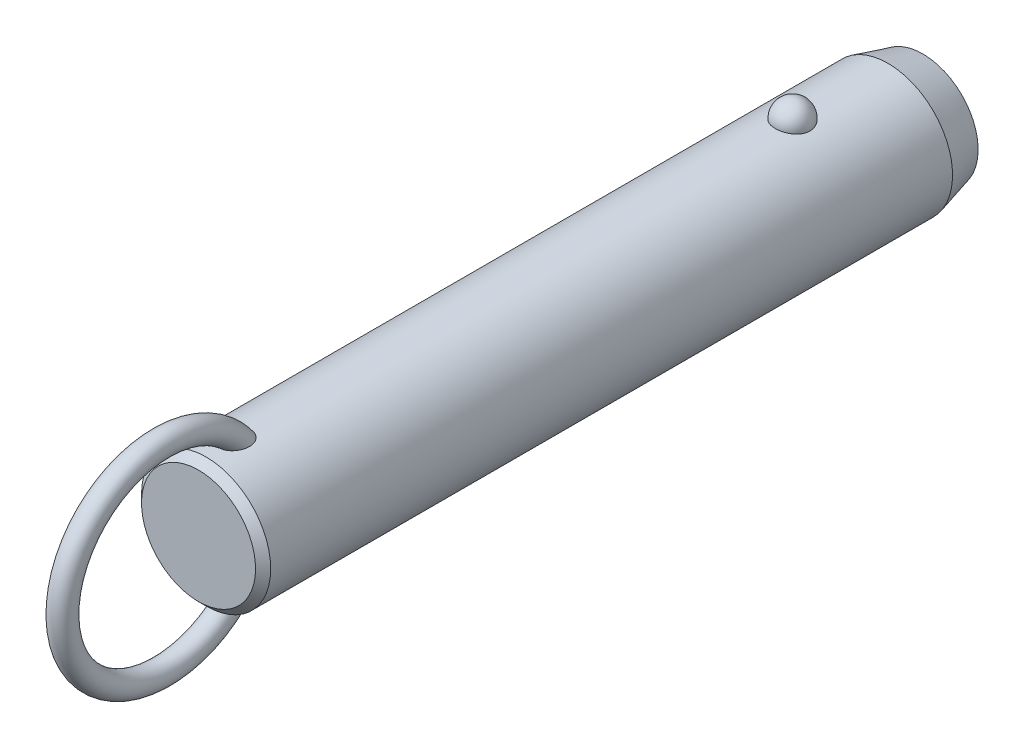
ISO-10303-21;
HEADER;
FILE_DESCRIPTION(('STEP AP214'),'2;1');
FILE_NAME('part.step','',(''),(''),'','','');
FILE_SCHEMA(('AUTOMOTIVE_DESIGN { 1 0 10303 214 1 1 1 1 }'));
ENDSEC;
DATA;
#1=APPLICATION_CONTEXT('core data for automotive mechanical design processes');
#2=APPLICATION_PROTOCOL_DEFINITION('international standard','automotive_design',2000,#1);
#3=PRODUCT_CONTEXT('',#1,'mechanical');
#4=PRODUCT('Part','Part','',(#3));
#5=PRODUCT_RELATED_PRODUCT_CATEGORY('part','',(#4));
#6=PRODUCT_DEFINITION_FORMATION('','',#4);
#7=PRODUCT_DEFINITION_CONTEXT('part definition',#1,'design');
#8=PRODUCT_DEFINITION('design','',#6,#7);
#9=PRODUCT_DEFINITION_SHAPE('','',#8);
#10=(LENGTH_UNIT() NAMED_UNIT(*) SI_UNIT(.MILLI.,.METRE.));
#11=(NAMED_UNIT(*) PLANE_ANGLE_UNIT() SI_UNIT($,.RADIAN.));
#12=(NAMED_UNIT(*) SI_UNIT($,.STERADIAN.) SOLID_ANGLE_UNIT());
#13=UNCERTAINTY_MEASURE_WITH_UNIT(LENGTH_MEASURE(1.E-05),#10,'distance_accuracy_value','');
#14=(GEOMETRIC_REPRESENTATION_CONTEXT(3) GLOBAL_UNCERTAINTY_ASSIGNED_CONTEXT((#13)) GLOBAL_UNIT_ASSIGNED_CONTEXT((#10,
#11,#12)) REPRESENTATION_CONTEXT('',''));
#15=CARTESIAN_POINT('',(0.,0.,0.));
#16=DIRECTION('',(0.,0.,1.));
#17=DIRECTION('',(1.,0.,0.));
#18=AXIS2_PLACEMENT_3D('',#15,#16,#17);
#19=CARTESIAN_POINT('',(0.,0.,86.4));
#20=DIRECTION('',(0.,0.,-1.));
#21=DIRECTION('',(-1.,0.,0.));
#22=AXIS2_PLACEMENT_3D('',#19,#20,#21);
#23=CYLINDRICAL_SURFACE('',#22,11.1);
#24=CARTESIAN_POINT('',(2.9724815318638,10.6945945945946,-3.));
#25=CARTESIAN_POINT('',(2.97247830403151,10.6945972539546,-2.83225059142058));
#26=CARTESIAN_POINT('',(2.95876598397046,10.6984356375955,-2.6644597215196));
#27=CARTESIAN_POINT('',(2.90424529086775,10.7133624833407,-2.33362381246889));
#28=CARTESIAN_POINT('',(2.8634252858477,10.7244540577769,-2.1705808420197));
#29=CARTESIAN_POINT('',(2.75573657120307,10.7526272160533,-1.85396767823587));
#30=CARTESIAN_POINT('',(2.68887937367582,10.7697061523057,-1.70039333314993));
#31=CARTESIAN_POINT('',(2.53079696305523,10.8079438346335,-1.40691598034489));
#32=CARTESIAN_POINT('',(2.43957264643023,10.8291024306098,-1.2670124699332));
#33=CARTESIAN_POINT('',(2.23458150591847,10.8732541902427,-1.00409565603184));
#34=CARTESIAN_POINT('',(2.12071295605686,10.8962553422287,-0.881162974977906));
#35=CARTESIAN_POINT('',(1.87365402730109,10.9414421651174,-0.656352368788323));
#36=CARTESIAN_POINT('',(1.74046358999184,10.9636278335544,-0.554474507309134));
#37=CARTESIAN_POINT('',(1.45872188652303,11.0046495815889,-0.374872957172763));
#38=CARTESIAN_POINT('',(1.31021276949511,11.0234944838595,-0.297085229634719));
#39=CARTESIAN_POINT('',(1.00170030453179,11.0557957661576,-0.16752977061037));
#40=CARTESIAN_POINT('',(0.841698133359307,11.0692526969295,-0.115759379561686));
#41=CARTESIAN_POINT('',(0.517607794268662,11.0890932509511,-0.0403925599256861));
#42=CARTESIAN_POINT('',(0.353633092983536,11.0955916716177,-0.0163383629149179));
#43=CARTESIAN_POINT('',(0.02384202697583,11.1011989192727,0.00445177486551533));
#44=CARTESIAN_POINT('',(-0.141974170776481,11.1003084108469,0.00119017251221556));
#45=CARTESIAN_POINT('',(-0.46840517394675,11.0912990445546,-0.0323233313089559));
#46=CARTESIAN_POINT('',(-0.629059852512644,11.0832767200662,-0.0622147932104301));
#47=CARTESIAN_POINT('',(-0.942937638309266,11.0609962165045,-0.147645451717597));
#48=CARTESIAN_POINT('',(-1.09616062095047,11.0467379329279,-0.203185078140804));
#49=CARTESIAN_POINT('',(-1.39181061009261,11.0134071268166,-0.3387529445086));
#50=CARTESIAN_POINT('',(-1.53417383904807,10.9943086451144,-0.418913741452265));
#51=CARTESIAN_POINT('',(-1.80342160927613,10.9533667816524,-0.601448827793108));
#52=CARTESIAN_POINT('',(-1.9303046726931,10.9315231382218,-0.703825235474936));
#53=CARTESIAN_POINT('',(-2.16747598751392,10.887005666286,-0.930091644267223));
#54=CARTESIAN_POINT('',(-2.27742774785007,10.8643239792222,-1.05433291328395));
#55=CARTESIAN_POINT('',(-2.47517316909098,10.8209886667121,-1.31966633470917));
#56=CARTESIAN_POINT('',(-2.56296538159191,10.8003351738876,-1.46075958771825));
#57=CARTESIAN_POINT('',(-2.71500300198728,10.7631304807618,-1.75753646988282));
#58=CARTESIAN_POINT('',(-2.77898901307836,10.7466250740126,-1.9133588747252));
#59=CARTESIAN_POINT('',(-2.88046189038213,10.7198747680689,-2.2339152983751));
#60=CARTESIAN_POINT('',(-2.91794947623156,10.709629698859,-2.39864907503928));
#61=CARTESIAN_POINT('',(-2.96537819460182,10.6965949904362,-2.73165170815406));
#62=CARTESIAN_POINT('',(-2.97542891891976,10.693775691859,-2.89990378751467));
#63=CARTESIAN_POINT('',(-2.96804271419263,10.6958279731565,-3.235752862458));
#64=CARTESIAN_POINT('',(-2.95060646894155,10.7006993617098,-3.40334987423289));
#65=CARTESIAN_POINT('',(-2.88883358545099,10.71753912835,-3.73233906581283));
#66=CARTESIAN_POINT('',(-2.84462026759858,10.7294749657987,-3.89375610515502));
#67=CARTESIAN_POINT('',(-2.73050447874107,10.7590797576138,-4.20667949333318));
#68=CARTESIAN_POINT('',(-2.66060103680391,10.7767489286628,-4.35818546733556));
#69=CARTESIAN_POINT('',(-2.49642559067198,10.8159599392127,-4.6478542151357));
#70=CARTESIAN_POINT('',(-2.40203047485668,10.8375211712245,-4.78594458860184));
#71=CARTESIAN_POINT('',(-2.19143488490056,10.8820570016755,-5.0441038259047));
#72=CARTESIAN_POINT('',(-2.07523364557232,10.9050316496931,-5.16417205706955));
#73=CARTESIAN_POINT('',(-1.82361254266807,10.9499219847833,-5.38334833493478));
#74=CARTESIAN_POINT('',(-1.68812945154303,10.9718338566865,-5.48238464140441));
#75=CARTESIAN_POINT('',(-1.40191298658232,11.0120611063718,-5.65618873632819));
#76=CARTESIAN_POINT('',(-1.25118062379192,11.0303767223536,-5.73095813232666));
#77=CARTESIAN_POINT('',(-0.94057074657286,11.0611653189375,-5.85334725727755));
#78=CARTESIAN_POINT('',(-0.780821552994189,11.0737044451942,-5.90127578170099));
#79=CARTESIAN_POINT('',(-0.455204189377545,11.0918598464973,-5.96992976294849));
#80=CARTESIAN_POINT('',(-0.289336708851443,11.0974768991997,-5.99065827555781));
#81=CARTESIAN_POINT('',(0.0406846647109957,11.1011307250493,-6.00418773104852));
#82=CARTESIAN_POINT('',(0.204817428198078,11.099299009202,-5.99747318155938));
#83=CARTESIAN_POINT('',(0.529553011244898,11.088551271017,-5.9574031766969));
#84=CARTESIAN_POINT('',(0.690155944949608,11.0796354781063,-5.92404858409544));
#85=CARTESIAN_POINT('',(1.0027760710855,11.0557204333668,-5.83180084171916));
#86=CARTESIAN_POINT('',(1.15482001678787,11.0407414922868,-5.77299291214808));
#87=CARTESIAN_POINT('',(1.44678373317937,11.0062913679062,-5.63147366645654));
#88=CARTESIAN_POINT('',(1.58670279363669,10.9868199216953,-5.54876095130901));
#89=CARTESIAN_POINT('',(1.8527023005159,10.9451315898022,-5.36027644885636));
#90=CARTESIAN_POINT('',(1.97855158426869,10.9228788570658,-5.25418644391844));
#91=CARTESIAN_POINT('',(2.21080872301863,10.8782509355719,-5.02251354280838));
#92=CARTESIAN_POINT('',(2.31721312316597,10.8558757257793,-4.89692718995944));
#93=CARTESIAN_POINT('',(2.5094551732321,10.8130715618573,-4.62745408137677));
#94=CARTESIAN_POINT('',(2.59493284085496,10.7926798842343,-4.48330448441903));
#95=CARTESIAN_POINT('',(2.740862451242,10.7565495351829,-4.18236358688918));
#96=CARTESIAN_POINT('',(2.80132490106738,10.7408089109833,-4.02557762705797));
#97=CARTESIAN_POINT('',(2.88959070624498,10.7173718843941,-3.72475308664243));
#98=CARTESIAN_POINT('',(2.92062102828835,10.7088950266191,-3.58171216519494));
#99=CARTESIAN_POINT('',(2.96206765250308,10.6975052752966,-3.29245795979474));
#100=CARTESIAN_POINT('',(2.97248434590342,10.6945922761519,-3.14624473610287));
#101=CARTESIAN_POINT('',(2.9724815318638,10.6945945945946,-3.));
#102=B_SPLINE_CURVE_WITH_KNOTS('',3,(#24,#25,#26,#27,#28,#29,#30,#31,#32,#33,#34,#35,#36,#37,
#38,#39,#40,#41,#42,#43,#44,#45,#46,#47,#48,#49,#50,#51,#52,#53,#54,#55,#56,#57,#58,#59,#60,#61,
#62,#63,#64,#65,#66,#67,#68,#69,#70,#71,#72,#73,#74,#75,#76,#77,#78,#79,#80,#81,#82,#83,#84,#85,
#86,#87,#88,#89,#90,#91,#92,#93,#94,#95,#96,#97,#98,#99,#100,#101),.UNSPECIFIED.,.T.,.F.,(4,2,2,
2,2,2,2,2,2,2,2,2,2,2,2,2,2,2,2,2,2,2,2,2,2,2,2,2,2,2,2,2,2,2,2,2,2,2,4),(0.,0.502722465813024,
1.00566079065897,1.50837699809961,2.01107471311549,2.51608392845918,3.02109467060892,
3.52475118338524,4.02835620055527,4.523518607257,5.0186364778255,5.50715297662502,
5.9956776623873,6.48688002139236,6.97812923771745,7.47814366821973,7.9781907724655,
8.48353712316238,8.9888697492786,9.49218093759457,9.99547960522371,10.4964777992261,
10.997494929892,11.5010810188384,12.0046847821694,12.5099796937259,13.0152411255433,
13.5145635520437,14.0138298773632,14.5043200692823,14.9947943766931,15.4836390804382,
15.9725123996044,16.4685040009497,16.9645836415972,17.4686765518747,17.972557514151,
18.410841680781,18.849117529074),.UNSPECIFIED.);
#103=CARTESIAN_POINT('',(2.9724815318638,10.6945945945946,-3.));
#104=VERTEX_POINT('',#103);
#105=EDGE_CURVE('E41',#104,#104,#102,.T.);
#106=ORIENTED_EDGE('',*,*,#105,.T.);
#107=EDGE_LOOP('',(#106));
#108=FACE_BOUND('',#107,.T.);
#109=CARTESIAN_POINT('',(0.,0.,97.8000000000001));
#110=DIRECTION('',(0.,0.,1.));
#111=DIRECTION('',(1.,0.,0.));
#112=AXIS2_PLACEMENT_3D('',#109,#110,#111);
#113=CIRCLE('',#112,11.1);
#114=CARTESIAN_POINT('',(11.1,0.,97.8000000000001));
#115=VERTEX_POINT('',#114);
#116=EDGE_CURVE('E10',#115,#115,#113,.F.);
#117=ORIENTED_EDGE('',*,*,#116,.T.);
#118=EDGE_LOOP('',(#117));
#119=FACE_BOUND('',#118,.T.);
#120=CARTESIAN_POINT('',(-0.564520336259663,-11.0856356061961,90.0578154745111));
#121=CARTESIAN_POINT('',(-0.667202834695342,-11.0804062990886,90.0912839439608));
#122=CARTESIAN_POINT('',(-0.766875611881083,-11.0738877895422,90.1338357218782));
#123=CARTESIAN_POINT('',(-0.957284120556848,-11.0590576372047,90.2354190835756));
#124=CARTESIAN_POINT('',(-1.04801616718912,-11.0507452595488,90.2944574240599));
#125=CARTESIAN_POINT('',(-1.21800952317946,-11.0333016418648,90.4265293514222));
#126=CARTESIAN_POINT('',(-1.29730805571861,-11.0241732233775,90.4995156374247));
#127=CARTESIAN_POINT('',(-1.44337665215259,-11.0060026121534,90.6570374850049));
#128=CARTESIAN_POINT('',(-1.51014622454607,-10.9969604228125,90.7415734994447));
#129=CARTESIAN_POINT('',(-1.63454620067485,-10.9791841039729,90.9255213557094));
#130=CARTESIAN_POINT('',(-1.69127003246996,-10.9705107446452,91.0255493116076));
#131=CARTESIAN_POINT('',(-1.78980785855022,-10.9548648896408,91.2327902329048));
#132=CARTESIAN_POINT('',(-1.83161214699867,-10.9478935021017,91.3400078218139));
#133=CARTESIAN_POINT('',(-1.91557028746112,-10.9335803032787,91.6054080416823));
#134=CARTESIAN_POINT('',(-1.95040620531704,-10.9273269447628,91.7659806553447));
#135=CARTESIAN_POINT('',(-1.99388326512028,-10.9194709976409,92.0906977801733));
#136=CARTESIAN_POINT('',(-2.00248051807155,-10.9178762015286,92.2548478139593));
#137=CARTESIAN_POINT('',(-1.99551615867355,-10.9191578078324,92.6246504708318));
#138=CARTESIAN_POINT('',(-1.9732206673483,-10.9232807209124,92.8301911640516));
#139=CARTESIAN_POINT('',(-1.91529761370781,-10.9335244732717,93.133595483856));
#140=CARTESIAN_POINT('',(-1.8918457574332,-10.9376266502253,93.2340883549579));
#141=CARTESIAN_POINT('',(-1.83700674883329,-10.9469720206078,93.432855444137));
#142=CARTESIAN_POINT('',(-1.80562070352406,-10.9522150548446,93.5311299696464));
#143=CARTESIAN_POINT('',(-1.73463055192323,-10.9636837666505,93.7259148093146));
#144=CARTESIAN_POINT('',(-1.69493416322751,-10.9699202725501,93.8223907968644));
#145=CARTESIAN_POINT('',(-1.60745141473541,-10.9830806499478,94.0116262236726));
#146=CARTESIAN_POINT('',(-1.55966150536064,-10.9900048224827,94.1043840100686));
#147=CARTESIAN_POINT('',(-1.45591812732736,-11.0042280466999,94.2846907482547));
#148=CARTESIAN_POINT('',(-1.40000013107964,-11.0115253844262,94.3722601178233));
#149=CARTESIAN_POINT('',(-1.27937470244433,-11.0261911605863,94.5410298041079));
#150=CARTESIAN_POINT('',(-1.21467835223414,-11.0335594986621,94.6222379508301));
#151=CARTESIAN_POINT('',(-1.08218150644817,-11.0473027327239,94.7690010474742));
#152=CARTESIAN_POINT('',(-1.01522633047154,-11.0537063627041,94.835309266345));
#153=CARTESIAN_POINT('',(-0.872952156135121,-11.065850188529,94.9583780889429));
#154=CARTESIAN_POINT('',(-0.797642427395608,-11.0715911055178,95.0151491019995));
#155=CARTESIAN_POINT('',(-0.651396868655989,-11.081071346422,95.1075155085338));
#156=CARTESIAN_POINT('',(-0.58171263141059,-11.0849841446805,95.1450491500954));
#157=CARTESIAN_POINT('',(-0.437066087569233,-11.0916271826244,95.2082594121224));
#158=CARTESIAN_POINT('',(-0.362109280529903,-11.0943586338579,95.2339481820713));
#159=CARTESIAN_POINT('',(-0.207828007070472,-11.0983242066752,95.271117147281));
#160=CARTESIAN_POINT('',(-0.128467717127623,-11.0995432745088,95.2824545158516));
#161=CARTESIAN_POINT('',(0.0309101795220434,-11.1002423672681,95.2889658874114));
#162=CARTESIAN_POINT('',(0.110927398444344,-11.0997233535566,95.2841488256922));
#163=CARTESIAN_POINT('',(0.256406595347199,-11.097240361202,95.2609599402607));
#164=CARTESIAN_POINT('',(0.32223577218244,-11.0955074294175,95.2447543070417));
#165=CARTESIAN_POINT('',(0.450635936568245,-11.0910350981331,95.2026008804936));
#166=CARTESIAN_POINT('',(0.513205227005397,-11.0882951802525,95.1766480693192));
#167=CARTESIAN_POINT('',(0.662626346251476,-11.0805620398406,95.1026073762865));
#168=CARTESIAN_POINT('',(0.747127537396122,-11.0751144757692,95.0498452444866));
#169=CARTESIAN_POINT('',(0.906756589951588,-11.0631932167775,94.9317206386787));
#170=CARTESIAN_POINT('',(0.981859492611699,-11.0567168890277,94.8663257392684));
#171=CARTESIAN_POINT('',(1.10712207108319,-11.0447856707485,94.7422633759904));
#172=CARTESIAN_POINT('',(1.1590956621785,-11.0394280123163,94.6853831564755));
#173=CARTESIAN_POINT('',(1.25791923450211,-11.0286040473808,94.5673271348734));
#174=CARTESIAN_POINT('',(1.3047664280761,-11.0231376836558,94.5061490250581));
#175=CARTESIAN_POINT('',(1.43818612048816,-11.0068027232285,94.317305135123));
#176=CARTESIAN_POINT('',(1.5175176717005,-10.9960104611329,94.1844531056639));
#177=CARTESIAN_POINT('',(1.63597546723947,-10.9788847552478,93.9531371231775));
#178=CARTESIAN_POINT('',(1.6798887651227,-10.9722190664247,93.8570530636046));
#179=CARTESIAN_POINT('',(1.75953241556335,-10.9597298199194,93.6614311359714));
#180=CARTESIAN_POINT('',(1.79525967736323,-10.9539065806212,93.5618919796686));
#181=CARTESIAN_POINT('',(1.85844731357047,-10.9433632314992,93.3602111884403));
#182=CARTESIAN_POINT('',(1.88591073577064,-10.9386427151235,93.2580705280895));
#183=CARTESIAN_POINT('',(1.9323432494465,-10.9305350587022,93.0518191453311));
#184=CARTESIAN_POINT('',(1.95131065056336,-10.9271481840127,92.9477080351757));
#185=CARTESIAN_POINT('',(1.99040203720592,-10.9201183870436,92.6654588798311));
#186=CARTESIAN_POINT('',(2.00221217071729,-10.9179256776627,92.4860370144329));
#187=CARTESIAN_POINT('',(1.99711676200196,-10.9188636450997,92.1277133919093));
#188=CARTESIAN_POINT('',(1.98026150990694,-10.9219849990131,91.948811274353));
#189=CARTESIAN_POINT('',(1.92151657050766,-10.9324473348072,91.6364514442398));
#190=CARTESIAN_POINT('',(1.88605081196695,-10.9386915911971,91.5017594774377));
#191=CARTESIAN_POINT('',(1.79393020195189,-10.9541780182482,91.2399669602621));
#192=CARTESIAN_POINT('',(1.73729868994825,-10.9634168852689,91.1128582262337));
#193=CARTESIAN_POINT('',(1.61237037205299,-10.9824218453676,90.8894184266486));
#194=CARTESIAN_POINT('',(1.54715374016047,-10.9918945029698,90.7913455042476));
#195=CARTESIAN_POINT('',(1.40127026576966,-11.0114415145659,90.6074341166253));
#196=CARTESIAN_POINT('',(1.32060742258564,-11.0215157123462,90.5215924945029));
#197=CARTESIAN_POINT('',(1.14474787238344,-11.041168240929,90.3651630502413));
#198=CARTESIAN_POINT('',(1.04947805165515,-11.0507437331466,90.2946565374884));
#199=CARTESIAN_POINT('',(0.847278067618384,-11.0680789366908,90.172640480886));
#200=CARTESIAN_POINT('',(0.74035174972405,-11.0758392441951,90.1211246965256));
#201=CARTESIAN_POINT('',(0.52928931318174,-11.0878275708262,90.0434852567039));
#202=CARTESIAN_POINT('',(0.425895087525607,-11.0923259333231,90.0153777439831));
#203=CARTESIAN_POINT('',(0.215723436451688,-11.0984001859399,89.9777038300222));
#204=CARTESIAN_POINT('',(0.108947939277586,-11.0999777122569,89.9681270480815));
#205=CARTESIAN_POINT('',(-0.0938962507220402,-11.1000196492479,89.9678773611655));
#206=CARTESIAN_POINT('',(-0.189967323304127,-11.0987797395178,89.9754089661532));
#207=CARTESIAN_POINT('',(-0.379657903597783,-11.0939111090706,90.0055079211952));
#208=CARTESIAN_POINT('',(-0.473277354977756,-11.0902823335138,90.0280756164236));
#209=CARTESIAN_POINT('',(-0.564520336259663,-11.0856356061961,90.0578154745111));
#210=B_SPLINE_CURVE_WITH_KNOTS('',3,(#120,#121,#122,#123,#124,#125,#126,#127,#128,#129,#130,
#131,#132,#133,#134,#135,#136,#137,#138,#139,#140,#141,#142,#143,#144,#145,#146,#147,#148,#149,
#150,#151,#152,#153,#154,#155,#156,#157,#158,#159,#160,#161,#162,#163,#164,#165,#166,#167,#168,
#169,#170,#171,#172,#173,#174,#175,#176,#177,#178,#179,#180,#181,#182,#183,#184,#185,#186,#187,
#188,#189,#190,#191,#192,#193,#194,#195,#196,#197,#198,#199,#200,#201,#202,#203,#204,#205,#206,
#207,#208,#209),.UNSPECIFIED.,.T.,.F.,(4,2,2,2,2,2,2,2,2,2,2,2,2,2,2,2,2,2,2,2,2,2,2,2,2,2,2,2,
2,2,2,2,2,2,2,2,2,2,2,2,2,2,2,2,4),(0.,0.323999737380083,0.648132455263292,0.971184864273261,
1.29424994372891,1.6388623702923,1.98369857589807,2.47426059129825,2.96564271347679,
3.58257396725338,3.89215258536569,4.20168803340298,4.51486273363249,4.82817514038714,
5.14015911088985,5.45175282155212,5.73442856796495,6.01679375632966,6.25364580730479,
6.49025437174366,6.72919963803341,6.96801276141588,7.17061258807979,7.37331685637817,
7.67094989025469,7.96935728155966,8.20075067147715,8.43226927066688,8.89581623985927,
9.21306533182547,9.53043400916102,9.8476854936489,10.1650000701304,10.70229304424,
11.2386443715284,11.6553390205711,12.0715755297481,12.4245637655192,12.7774607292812,
13.1321855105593,13.4867936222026,13.8068771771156,14.1267813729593,14.4146787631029,
14.7025827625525),.UNSPECIFIED.);
#211=CARTESIAN_POINT('',(-0.564520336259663,-11.0856356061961,90.0578154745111));
#212=VERTEX_POINT('',#211);
#213=EDGE_CURVE('E60',#212,#212,#210,.T.);
#214=ORIENTED_EDGE('',*,*,#213,.T.);
#215=EDGE_LOOP('',(#214));
#216=FACE_BOUND('',#215,.T.);
#217=CARTESIAN_POINT('',(-0.564520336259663,11.0856356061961,90.0578154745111));
#218=CARTESIAN_POINT('',(-0.468542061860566,11.0905203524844,90.0265456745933));
#219=CARTESIAN_POINT('',(-0.36979381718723,11.0942886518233,90.0031576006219));
#220=CARTESIAN_POINT('',(-0.169555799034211,11.0991586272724,89.9730858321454));
#221=CARTESIAN_POINT('',(-0.0680604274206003,11.1002543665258,89.9664393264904));
#222=CARTESIAN_POINT('',(0.134549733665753,11.099646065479,89.9701579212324));
#223=CARTESIAN_POINT('',(0.235664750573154,11.0979441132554,89.9805103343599));
#224=CARTESIAN_POINT('',(0.434632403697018,11.0919342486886,90.0178318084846));
#225=CARTESIAN_POINT('',(0.53248665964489,11.0876276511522,90.0447924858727));
#226=CARTESIAN_POINT('',(0.72244585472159,11.0768742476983,90.1144096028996));
#227=CARTESIAN_POINT('',(0.814543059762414,11.0704246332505,90.1570866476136));
#228=CARTESIAN_POINT('',(0.990565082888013,11.0560659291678,90.2566487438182));
#229=CARTESIAN_POINT('',(1.07448844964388,11.048156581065,90.3135363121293));
#230=CARTESIAN_POINT('',(1.23562672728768,11.0313221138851,90.4422106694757));
#231=CARTESIAN_POINT('',(1.31242684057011,11.0223686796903,90.5145117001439));
#232=CARTESIAN_POINT('',(1.45398030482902,11.0045918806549,90.6700425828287));
#233=CARTESIAN_POINT('',(1.51873073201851,10.9957685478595,90.7532750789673));
#234=CARTESIAN_POINT('',(1.64107232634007,10.9782087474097,90.9363842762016));
#235=CARTESIAN_POINT('',(1.69743176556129,10.9695572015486,91.0370893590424));
#236=CARTESIAN_POINT('',(1.79515063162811,10.9539887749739,91.2456264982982));
#237=CARTESIAN_POINT('',(1.83649966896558,10.9470730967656,91.3534634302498));
#238=CARTESIAN_POINT('',(1.91931148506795,10.9329211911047,91.6203995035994));
#239=CARTESIAN_POINT('',(1.95340104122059,10.9267904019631,91.7818612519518));
#240=CARTESIAN_POINT('',(1.99526195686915,10.9192174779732,92.1082163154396));
#241=CARTESIAN_POINT('',(2.00298989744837,10.9177830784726,92.2731148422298));
#242=CARTESIAN_POINT('',(1.99396251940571,10.9194420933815,92.6441006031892));
#243=CARTESIAN_POINT('',(1.97050829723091,10.923774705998,92.8500387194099));
#244=CARTESIAN_POINT('',(1.91079643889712,10.9343131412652,93.1539019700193));
#245=CARTESIAN_POINT('',(1.88673702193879,10.9385106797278,93.2545296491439));
#246=CARTESIAN_POINT('',(1.83065508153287,10.9480376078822,93.4535107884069));
#247=CARTESIAN_POINT('',(1.79863369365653,10.9533668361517,93.551864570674));
#248=CARTESIAN_POINT('',(1.72633365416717,10.9649954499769,93.746720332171));
#249=CARTESIAN_POINT('',(1.68596409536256,10.9713053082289,93.8431879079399));
#250=CARTESIAN_POINT('',(1.59707998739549,10.9845964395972,94.0323233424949));
#251=CARTESIAN_POINT('',(1.54856169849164,10.9915780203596,94.1249894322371));
#252=CARTESIAN_POINT('',(1.44330168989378,11.0058935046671,94.3049752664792));
#253=CARTESIAN_POINT('',(1.38659749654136,11.0132257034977,94.392316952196));
#254=CARTESIAN_POINT('',(1.26431158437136,11.0279330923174,94.5604563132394));
#255=CARTESIAN_POINT('',(1.19874160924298,11.0353082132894,94.6412624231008));
#256=CARTESIAN_POINT('',(1.06542088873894,11.0489310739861,94.7859856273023));
#257=CARTESIAN_POINT('',(0.998640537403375,11.0552153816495,94.850784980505));
#258=CARTESIAN_POINT('',(0.856896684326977,11.0671032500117,94.9708462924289));
#259=CARTESIAN_POINT('',(0.781942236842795,11.0727075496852,95.0261186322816));
#260=CARTESIAN_POINT('',(0.636276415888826,11.081949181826,95.1159721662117));
#261=CARTESIAN_POINT('',(0.566755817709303,11.0857572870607,95.1524410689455));
#262=CARTESIAN_POINT('',(0.422602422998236,11.0921860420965,95.2135333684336));
#263=CARTESIAN_POINT('',(0.347974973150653,11.0948079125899,95.2381689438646));
#264=CARTESIAN_POINT('',(0.194593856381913,11.0985608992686,95.2733233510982));
#265=CARTESIAN_POINT('',(0.115807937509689,11.0996777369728,95.2837069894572));
#266=CARTESIAN_POINT('',(-0.0422499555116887,11.1002003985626,95.2885747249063));
#267=CARTESIAN_POINT('',(-0.121521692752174,11.09960699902,95.283066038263));
#268=CARTESIAN_POINT('',(-0.266046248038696,11.0970123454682,95.2588271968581));
#269=CARTESIAN_POINT('',(-0.331661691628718,11.0952283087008,95.2421356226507));
#270=CARTESIAN_POINT('',(-0.459588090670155,11.0906663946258,95.1991117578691));
#271=CARTESIAN_POINT('',(-0.521897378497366,11.0878880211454,95.172774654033));
#272=CARTESIAN_POINT('',(-0.671446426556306,11.0800342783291,95.0975130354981));
#273=CARTESIAN_POINT('',(-0.756250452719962,11.0744969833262,95.0438182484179));
#274=CARTESIAN_POINT('',(-0.916349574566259,11.0624045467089,94.9238029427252));
#275=CARTESIAN_POINT('',(-0.99161892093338,11.0558467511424,94.8574493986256));
#276=CARTESIAN_POINT('',(-1.11713140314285,11.0437783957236,94.7316335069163));
#277=CARTESIAN_POINT('',(-1.16920539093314,11.0383619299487,94.6739524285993));
#278=CARTESIAN_POINT('',(-1.26817476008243,11.02743010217,94.5542809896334));
#279=CARTESIAN_POINT('',(-1.31506731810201,11.0219146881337,94.4922883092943));
#280=CARTESIAN_POINT('',(-1.40399813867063,11.0109399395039,94.3647843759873));
#281=CARTESIAN_POINT('',(-1.4460286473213,11.0054807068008,94.2992677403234));
#282=CARTESIAN_POINT('',(-1.52538779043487,10.9947621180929,94.1654223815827));
#283=CARTESIAN_POINT('',(-1.56271516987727,10.9895028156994,94.0970929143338));
#284=CARTESIAN_POINT('',(-1.64537943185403,10.9774790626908,93.9332101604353));
#285=CARTESIAN_POINT('',(-1.68879497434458,10.9708503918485,93.8366735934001));
#286=CARTESIAN_POINT('',(-1.76740738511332,10.9584602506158,93.6402369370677));
#287=CARTESIAN_POINT('',(-1.80260120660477,10.95269910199,93.5403356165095));
#288=CARTESIAN_POINT('',(-1.86468657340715,10.9423003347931,93.3379663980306));
#289=CARTESIAN_POINT('',(-1.89158164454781,10.9376622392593,93.2354996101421));
#290=CARTESIAN_POINT('',(-1.93682458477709,10.9297405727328,93.0286429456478));
#291=CARTESIAN_POINT('',(-1.9551708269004,10.9264572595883,92.9242527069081));
#292=CARTESIAN_POINT('',(-1.99232562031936,10.9197647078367,92.6426287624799));
#293=CARTESIAN_POINT('',(-2.00294603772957,10.9177914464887,92.4641857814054));
#294=CARTESIAN_POINT('',(-1.99566675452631,10.9191290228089,92.1079962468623));
#295=CARTESIAN_POINT('',(-1.97781651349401,10.9224306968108,91.9302490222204));
#296=CARTESIAN_POINT('',(-1.91747214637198,10.9331592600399,91.6197921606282));
#297=CARTESIAN_POINT('',(-1.88131022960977,10.9395108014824,91.485825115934));
#298=CARTESIAN_POINT('',(-1.7879038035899,10.9551659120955,91.2255975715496));
#299=CARTESIAN_POINT('',(-1.7306830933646,10.9644661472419,91.0993285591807));
#300=CARTESIAN_POINT('',(-1.60475573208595,10.9835398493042,90.8774156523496));
#301=CARTESIAN_POINT('',(-1.53908879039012,10.9930297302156,90.7800265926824));
#302=CARTESIAN_POINT('',(-1.39238608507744,11.0125708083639,90.5975250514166));
#303=CARTESIAN_POINT('',(-1.31135150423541,11.0226219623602,90.5124116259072));
#304=CARTESIAN_POINT('',(-1.14382035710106,11.0411991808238,90.3652994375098));
#305=CARTESIAN_POINT('',(-1.05858500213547,11.0497792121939,90.3018693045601));
#306=CARTESIAN_POINT('',(-0.878723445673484,11.0655285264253,90.1902505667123));
#307=CARTESIAN_POINT('',(-0.784123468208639,11.0727015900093,90.1420208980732));
#308=CARTESIAN_POINT('',(-0.646163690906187,11.0812501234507,90.086023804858));
#309=CARTESIAN_POINT('',(-0.605595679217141,11.0835451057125,90.0711978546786));
#310=CARTESIAN_POINT('',(-0.564520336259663,11.0856356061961,90.0578154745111));
#311=B_SPLINE_CURVE_WITH_KNOTS('',3,(#217,#218,#219,#220,#221,#222,#223,#224,#225,#226,#227,
#228,#229,#230,#231,#232,#233,#234,#235,#236,#237,#238,#239,#240,#241,#242,#243,#244,#245,#246,
#247,#248,#249,#250,#251,#252,#253,#254,#255,#256,#257,#258,#259,#260,#261,#262,#263,#264,#265,
#266,#267,#268,#269,#270,#271,#272,#273,#274,#275,#276,#277,#278,#279,#280,#281,#282,#283,#284,
#285,#286,#287,#288,#289,#290,#291,#292,#293,#294,#295,#296,#297,#298,#299,#300,#301,#302,#303,
#304,#305,#306,#307,#308,#309,#310),.UNSPECIFIED.,.T.,.F.,(4,2,2,2,2,2,2,2,2,2,2,2,2,2,2,2,2,2,
2,2,2,2,2,2,2,2,2,2,2,2,2,2,2,2,2,2,2,2,2,2,2,2,2,2,2,2,4),(0.,0.303061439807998,
0.606795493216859,0.910302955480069,1.21365733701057,1.51741085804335,1.82121821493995,
2.13745205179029,2.45376252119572,2.79958678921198,3.14564996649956,3.6383239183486,
4.13180893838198,4.75031912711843,5.06071926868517,5.37107516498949,5.68500772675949,
5.99908475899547,6.31176519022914,6.62403542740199,6.90315673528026,7.1819719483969,
7.41687778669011,7.65154134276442,7.88841587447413,8.12518286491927,8.3275284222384,
8.52997509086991,8.82986421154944,9.13054668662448,9.36393502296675,9.59744991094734,
9.83133221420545,10.0652767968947,10.383032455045,10.7009056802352,11.0186436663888,
11.3364420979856,11.8705925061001,12.4038159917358,12.8189662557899,13.2336487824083,
13.5857049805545,13.9377340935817,14.2561354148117,14.5736690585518,14.7033687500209),.UNSPECIFIED.);
#312=CARTESIAN_POINT('',(-0.564520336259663,11.0856356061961,90.0578154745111));
#313=VERTEX_POINT('',#312);
#314=EDGE_CURVE('E68',#313,#313,#311,.T.);
#315=ORIENTED_EDGE('',*,*,#314,.T.);
#316=EDGE_LOOP('',(#315));
#317=FACE_BOUND('',#316,.T.);
#318=CARTESIAN_POINT('',(0.,0.,-19.4000000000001));
#319=DIRECTION('',(0.,0.,-1.));
#320=DIRECTION('',(-1.,0.,0.));
#321=AXIS2_PLACEMENT_3D('',#318,#319,#320);
#322=CIRCLE('',#321,11.1);
#323=CARTESIAN_POINT('',(-11.1,0.,-19.4000000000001));
#324=VERTEX_POINT('',#323);
#325=EDGE_CURVE('E57',#324,#324,#322,.F.);
#326=ORIENTED_EDGE('',*,*,#325,.T.);
#327=EDGE_LOOP('',(#326));
#328=FACE_BOUND('',#327,.T.);
#329=ADVANCED_FACE('F37',(#108,#119,#216,#317,#328),#23,.T.);
#330=CARTESIAN_POINT('',(0.,0.,-25.4));
#331=DIRECTION('',(0.,0.,-1.));
#332=DIRECTION('',(-1.,0.,0.));
#333=AXIS2_PLACEMENT_3D('',#330,#331,#332);
#334=PLANE('',#333);
#335=CARTESIAN_POINT('',(0.,0.,-25.4));
#336=DIRECTION('',(0.,0.,-1.));
#337=DIRECTION('',(-1.,0.,0.));
#338=AXIS2_PLACEMENT_3D('',#335,#336,#337);
#339=CIRCLE('',#338,9.49230484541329);
#340=CARTESIAN_POINT('',(-9.49230484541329,0.,-25.4));
#341=VERTEX_POINT('',#340);
#342=EDGE_CURVE('E67',#341,#341,#339,.T.);
#343=ORIENTED_EDGE('',*,*,#342,.T.);
#344=EDGE_LOOP('',(#343));
#345=FACE_BOUND('',#344,.T.);
#346=ADVANCED_FACE('F86',(#345),#334,.T.);
#347=CARTESIAN_POINT('',(0.,0.,-25.4));
#348=DIRECTION('',(0.,0.,1.));
#349=DIRECTION('',(1.,0.,0.));
#350=AXIS2_PLACEMENT_3D('',#347,#348,#349);
#351=CONICAL_SURFACE('',#350,9.49230484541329,0.26179938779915);
#352=ORIENTED_EDGE('',*,*,#325,.F.);
#353=EDGE_LOOP('',(#352));
#354=FACE_BOUND('',#353,.T.);
#355=ORIENTED_EDGE('',*,*,#342,.F.);
#356=EDGE_LOOP('',(#355));
#357=FACE_BOUND('',#356,.T.);
#358=ADVANCED_FACE('F84',(#354,#357),#351,.T.);
#359=CARTESIAN_POINT('',(0.,0.,99.1));
#360=DIRECTION('',(0.,0.,1.));
#361=DIRECTION('',(1.,0.,0.));
#362=AXIS2_PLACEMENT_3D('',#359,#360,#361);
#363=PLANE('',#362);
#364=CARTESIAN_POINT('',(0.,0.,99.1));
#365=DIRECTION('',(0.,0.,1.));
#366=DIRECTION('',(1.,0.,0.));
#367=AXIS2_PLACEMENT_3D('',#364,#365,#366);
#368=CIRCLE('',#367,9.80000000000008);
#369=CARTESIAN_POINT('',(9.80000000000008,0.,99.1));
#370=VERTEX_POINT('',#369);
#371=EDGE_CURVE('E50',#370,#370,#368,.T.);
#372=ORIENTED_EDGE('',*,*,#371,.T.);
#373=EDGE_LOOP('',(#372));
#374=FACE_BOUND('',#373,.T.);
#375=ADVANCED_FACE('F78',(#374),#363,.T.);
#376=CARTESIAN_POINT('',(0.,0.,105.45));
#377=DIRECTION('',(1.,0.,0.));
#378=DIRECTION('',(0.,0.,-1.));
#379=AXIS2_PLACEMENT_3D('',#376,#377,#378);
#380=TOROIDAL_SURFACE('',#379,17.05,2.);
#381=ORIENTED_EDGE('',*,*,#314,.F.);
#382=EDGE_LOOP('',(#381));
#383=FACE_BOUND('',#382,.T.);
#384=ORIENTED_EDGE('',*,*,#213,.F.);
#385=EDGE_LOOP('',(#384));
#386=FACE_BOUND('',#385,.T.);
#387=ADVANCED_FACE('F74',(#383,#386),#380,.T.);
#388=CARTESIAN_POINT('',(0.,0.,99.1));
#389=DIRECTION('',(0.,0.,-1.));
#390=DIRECTION('',(-1.,0.,0.));
#391=AXIS2_PLACEMENT_3D('',#388,#389,#390);
#392=CONICAL_SURFACE('',#391,9.80000000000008,0.785398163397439);
#393=ORIENTED_EDGE('',*,*,#116,.F.);
#394=EDGE_LOOP('',(#393));
#395=FACE_BOUND('',#394,.T.);
#396=ORIENTED_EDGE('',*,*,#371,.F.);
#397=EDGE_LOOP('',(#396));
#398=FACE_BOUND('',#397,.T.);
#399=ADVANCED_FACE('F39',(#395,#398),#392,.T.);
#400=CARTESIAN_POINT('',(0.,11.1,-3.));
#401=DIRECTION('',(0.,1.,0.));
#402=DIRECTION('',(0.,0.,-1.));
#403=AXIS2_PLACEMENT_3D('',#400,#401,#402);
#404=SPHERICAL_SURFACE('',#403,3.);
#405=ORIENTED_EDGE('',*,*,#105,.F.);
#406=EDGE_LOOP('',(#405));
#407=FACE_BOUND('',#406,.T.);
#408=ADVANCED_FACE('F80',(#407),#404,.T.);
#409=CLOSED_SHELL('',(#329,#346,#358,#375,#387,#399,#408));
#410=MANIFOLD_SOLID_BREP('B2',#409);
#411=ADVANCED_BREP_SHAPE_REPRESENTATION('',(#18,#410),#14);
#412=SHAPE_DEFINITION_REPRESENTATION(#9,#411);
ENDSEC;
END-ISO-10303-21;
